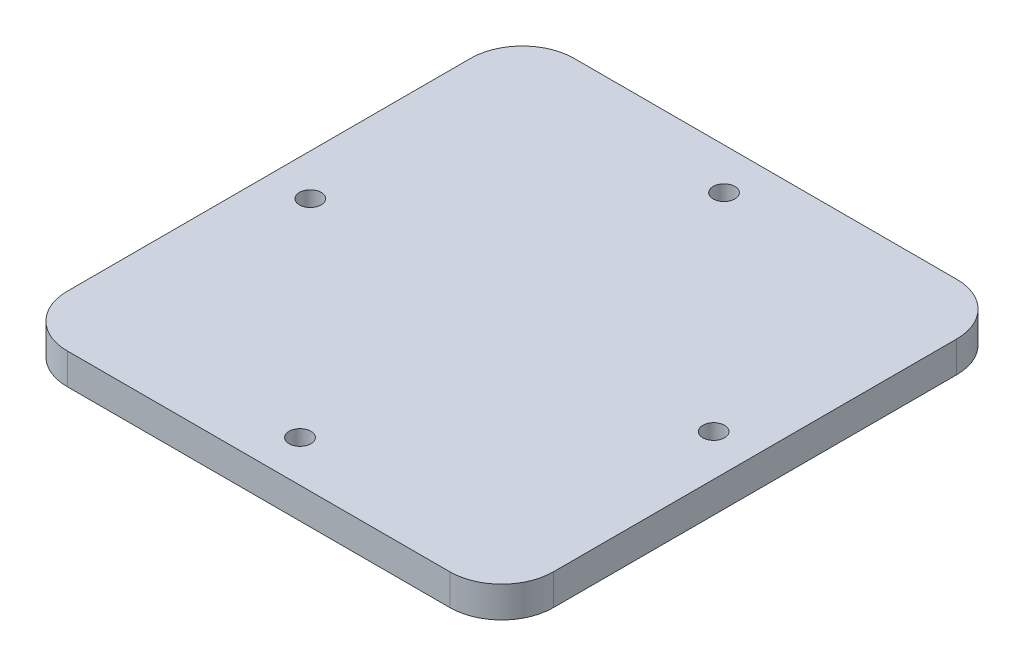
ISO-10303-21;
HEADER;
FILE_DESCRIPTION(('STEP AP214'),'2;1');
FILE_NAME('part.step','',(''),(''),'','','');
FILE_SCHEMA(('AUTOMOTIVE_DESIGN { 1 0 10303 214 1 1 1 1 }'));
ENDSEC;
DATA;
#1=APPLICATION_CONTEXT('core data for automotive mechanical design processes');
#2=APPLICATION_PROTOCOL_DEFINITION('international standard','automotive_design',2000,#1);
#3=PRODUCT_CONTEXT('',#1,'mechanical');
#4=PRODUCT('Part','Part','',(#3));
#5=PRODUCT_RELATED_PRODUCT_CATEGORY('part','',(#4));
#6=PRODUCT_DEFINITION_FORMATION('','',#4);
#7=PRODUCT_DEFINITION_CONTEXT('part definition',#1,'design');
#8=PRODUCT_DEFINITION('design','',#6,#7);
#9=PRODUCT_DEFINITION_SHAPE('','',#8);
#10=(LENGTH_UNIT() NAMED_UNIT(*) SI_UNIT(.MILLI.,.METRE.));
#11=(NAMED_UNIT(*) PLANE_ANGLE_UNIT() SI_UNIT($,.RADIAN.));
#12=(NAMED_UNIT(*) SI_UNIT($,.STERADIAN.) SOLID_ANGLE_UNIT());
#13=UNCERTAINTY_MEASURE_WITH_UNIT(LENGTH_MEASURE(1.E-05),#10,'distance_accuracy_value','');
#14=(GEOMETRIC_REPRESENTATION_CONTEXT(3) GLOBAL_UNCERTAINTY_ASSIGNED_CONTEXT((#13)) GLOBAL_UNIT_ASSIGNED_CONTEXT((#10,
#11,#12)) REPRESENTATION_CONTEXT('',''));
#15=CARTESIAN_POINT('',(0.,0.,0.));
#16=DIRECTION('',(0.,0.,1.));
#17=DIRECTION('',(1.,0.,0.));
#18=AXIS2_PLACEMENT_3D('',#15,#16,#17);
#19=CARTESIAN_POINT('',(9.99999999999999,0.,-88.));
#20=DIRECTION('',(0.,-1.,0.));
#21=DIRECTION('',(0.,0.,-1.));
#22=AXIS2_PLACEMENT_3D('',#19,#20,#21);
#23=PLANE('',#22);
#24=CARTESIAN_POINT('',(47.,0.,-90.));
#25=DIRECTION('',(0.,1.,0.));
#26=DIRECTION('',(0.,0.,1.));
#27=AXIS2_PLACEMENT_3D('',#24,#25,#26);
#28=CIRCLE('',#27,2.1);
#29=CARTESIAN_POINT('',(47.,0.,-87.9));
#30=VERTEX_POINT('',#29);
#31=EDGE_CURVE('E193',#30,#30,#28,.T.);
#32=ORIENTED_EDGE('',*,*,#31,.T.);
#33=EDGE_LOOP('',(#32));
#34=FACE_BOUND('',#33,.T.);
#35=CARTESIAN_POINT('',(7.99999999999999,0.,-49.));
#36=DIRECTION('',(0.,1.,0.));
#37=DIRECTION('',(0.,0.,1.));
#38=AXIS2_PLACEMENT_3D('',#35,#36,#37);
#39=CIRCLE('',#38,2.1);
#40=CARTESIAN_POINT('',(7.99999999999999,0.,-46.9));
#41=VERTEX_POINT('',#40);
#42=EDGE_CURVE('E187',#41,#41,#39,.T.);
#43=ORIENTED_EDGE('',*,*,#42,.T.);
#44=EDGE_LOOP('',(#43));
#45=FACE_BOUND('',#44,.T.);
#46=CARTESIAN_POINT('',(47.,0.,-8.));
#47=DIRECTION('',(0.,1.,0.));
#48=DIRECTION('',(0.,0.,1.));
#49=AXIS2_PLACEMENT_3D('',#46,#47,#48);
#50=CIRCLE('',#49,2.1);
#51=CARTESIAN_POINT('',(47.,0.,-5.9));
#52=VERTEX_POINT('',#51);
#53=EDGE_CURVE('E181',#52,#52,#50,.T.);
#54=ORIENTED_EDGE('',*,*,#53,.T.);
#55=EDGE_LOOP('',(#54));
#56=FACE_BOUND('',#55,.T.);
#57=CARTESIAN_POINT('',(9.99999999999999,0.,-88.));
#58=DIRECTION('',(0.,1.,0.));
#59=DIRECTION('',(0.,0.,-1.));
#60=AXIS2_PLACEMENT_3D('',#57,#58,#59);
#61=CIRCLE('',#60,10.);
#62=CARTESIAN_POINT('',(9.99999999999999,0.,-98.));
#63=VERTEX_POINT('',#62);
#64=CARTESIAN_POINT('',(0.,0.,-88.));
#65=VERTEX_POINT('',#64);
#66=EDGE_CURVE('E128',#63,#65,#61,.T.);
#67=ORIENTED_EDGE('',*,*,#66,.F.);
#68=DIRECTION('',(-1.,0.,0.));
#69=VECTOR('',#68,1.);
#70=CARTESIAN_POINT('',(9.99999999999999,0.,-98.));
#71=LINE('',#70,#69);
#72=CARTESIAN_POINT('',(84.,0.,-98.));
#73=VERTEX_POINT('',#72);
#74=EDGE_CURVE('E83',#73,#63,#71,.T.);
#75=ORIENTED_EDGE('',*,*,#74,.F.);
#76=CARTESIAN_POINT('',(84.,0.,-88.));
#77=DIRECTION('',(0.,1.,0.));
#78=DIRECTION('',(0.,0.,1.));
#79=AXIS2_PLACEMENT_3D('',#76,#77,#78);
#80=CIRCLE('',#79,9.99999999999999);
#81=CARTESIAN_POINT('',(94.,0.,-88.));
#82=VERTEX_POINT('',#81);
#83=EDGE_CURVE('E77',#82,#73,#80,.T.);
#84=ORIENTED_EDGE('',*,*,#83,.F.);
#85=DIRECTION('',(0.,0.,-1.));
#86=VECTOR('',#85,1.);
#87=CARTESIAN_POINT('',(94.,0.,-10.));
#88=LINE('',#87,#86);
#89=CARTESIAN_POINT('',(94.,0.,-10.));
#90=VERTEX_POINT('',#89);
#91=EDGE_CURVE('E118',#90,#82,#88,.T.);
#92=ORIENTED_EDGE('',*,*,#91,.F.);
#93=CARTESIAN_POINT('',(84.,0.,-10.));
#94=DIRECTION('',(0.,1.,0.));
#95=DIRECTION('',(0.,0.,-1.));
#96=AXIS2_PLACEMENT_3D('',#93,#94,#95);
#97=CIRCLE('',#96,10.);
#98=CARTESIAN_POINT('',(84.,0.,0.));
#99=VERTEX_POINT('',#98);
#100=EDGE_CURVE('E138',#99,#90,#97,.T.);
#101=ORIENTED_EDGE('',*,*,#100,.F.);
#102=DIRECTION('',(1.,0.,0.));
#103=VECTOR('',#102,1.);
#104=CARTESIAN_POINT('',(10.0000000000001,0.,0.));
#105=LINE('',#104,#103);
#106=CARTESIAN_POINT('',(10.0000000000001,0.,0.));
#107=VERTEX_POINT('',#106);
#108=EDGE_CURVE('E136',#107,#99,#105,.T.);
#109=ORIENTED_EDGE('',*,*,#108,.F.);
#110=CARTESIAN_POINT('',(10.,0.,-10.));
#111=DIRECTION('',(0.,1.,0.));
#112=DIRECTION('',(0.,0.,-1.));
#113=AXIS2_PLACEMENT_3D('',#110,#111,#112);
#114=CIRCLE('',#113,10.);
#115=CARTESIAN_POINT('',(0.,0.,-10.0000000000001));
#116=VERTEX_POINT('',#115);
#117=EDGE_CURVE('E134',#116,#107,#114,.T.);
#118=ORIENTED_EDGE('',*,*,#117,.F.);
#119=DIRECTION('',(0.,0.,1.));
#120=VECTOR('',#119,1.);
#121=CARTESIAN_POINT('',(0.,0.,-10.0000000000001));
#122=LINE('',#121,#120);
#123=EDGE_CURVE('E131',#65,#116,#122,.T.);
#124=ORIENTED_EDGE('',*,*,#123,.F.);
#125=EDGE_LOOP('',(#67,#75,#84,#92,#101,#109,#118,#124));
#126=FACE_BOUND('',#125,.T.);
#127=CARTESIAN_POINT('',(86.,0.,-49.));
#128=DIRECTION('',(0.,1.,0.));
#129=DIRECTION('',(0.,0.,1.));
#130=AXIS2_PLACEMENT_3D('',#127,#128,#129);
#131=CIRCLE('',#130,2.09999999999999);
#132=CARTESIAN_POINT('',(86.,0.,-46.9));
#133=VERTEX_POINT('',#132);
#134=EDGE_CURVE('E132',#133,#133,#131,.T.);
#135=ORIENTED_EDGE('',*,*,#134,.T.);
#136=EDGE_LOOP('',(#135));
#137=FACE_BOUND('',#136,.T.);
#138=ADVANCED_FACE('F31',(#34,#45,#56,#126,#137),#23,.T.);
#139=CARTESIAN_POINT('',(9.99999999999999,6.,-88.));
#140=DIRECTION('',(0.,-1.,0.));
#141=DIRECTION('',(0.,0.,-1.));
#142=AXIS2_PLACEMENT_3D('',#139,#140,#141);
#143=CYLINDRICAL_SURFACE('',#142,10.);
#144=ORIENTED_EDGE('',*,*,#66,.T.);
#145=DIRECTION('',(0.,-1.,0.));
#146=VECTOR('',#145,1.);
#147=CARTESIAN_POINT('',(0.,6.,-88.));
#148=LINE('',#147,#146);
#149=CARTESIAN_POINT('',(0.,6.,-88.));
#150=VERTEX_POINT('',#149);
#151=EDGE_CURVE('E11',#150,#65,#148,.T.);
#152=ORIENTED_EDGE('',*,*,#151,.F.);
#153=CARTESIAN_POINT('',(9.99999999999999,6.,-88.));
#154=DIRECTION('',(0.,1.,0.));
#155=DIRECTION('',(0.,0.,-1.));
#156=AXIS2_PLACEMENT_3D('',#153,#154,#155);
#157=CIRCLE('',#156,10.);
#158=CARTESIAN_POINT('',(9.99999999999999,6.,-98.));
#159=VERTEX_POINT('',#158);
#160=EDGE_CURVE('E143',#159,#150,#157,.T.);
#161=ORIENTED_EDGE('',*,*,#160,.F.);
#162=DIRECTION('',(0.,-1.,0.));
#163=VECTOR('',#162,1.);
#164=CARTESIAN_POINT('',(9.99999999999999,6.,-98.));
#165=LINE('',#164,#163);
#166=EDGE_CURVE('E124',#159,#63,#165,.T.);
#167=ORIENTED_EDGE('',*,*,#166,.T.);
#168=EDGE_LOOP('',(#144,#152,#161,#167));
#169=FACE_BOUND('',#168,.T.);
#170=ADVANCED_FACE('F33',(#169),#143,.T.);
#171=CARTESIAN_POINT('',(0.,6.,-10.0000000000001));
#172=DIRECTION('',(1.,0.,0.));
#173=DIRECTION('',(0.,0.,-1.));
#174=AXIS2_PLACEMENT_3D('',#171,#172,#173);
#175=PLANE('',#174);
#176=ORIENTED_EDGE('',*,*,#123,.T.);
#177=DIRECTION('',(0.,-1.,0.));
#178=VECTOR('',#177,1.);
#179=CARTESIAN_POINT('',(0.,6.,-10.0000000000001));
#180=LINE('',#179,#178);
#181=CARTESIAN_POINT('',(0.,6.,-10.0000000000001));
#182=VERTEX_POINT('',#181);
#183=EDGE_CURVE('E40',#182,#116,#180,.T.);
#184=ORIENTED_EDGE('',*,*,#183,.F.);
#185=DIRECTION('',(0.,0.,1.));
#186=VECTOR('',#185,1.);
#187=CARTESIAN_POINT('',(0.,6.,-10.0000000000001));
#188=LINE('',#187,#186);
#189=EDGE_CURVE('E91',#150,#182,#188,.T.);
#190=ORIENTED_EDGE('',*,*,#189,.F.);
#191=ORIENTED_EDGE('',*,*,#151,.T.);
#192=EDGE_LOOP('',(#176,#184,#190,#191));
#193=FACE_BOUND('',#192,.T.);
#194=ADVANCED_FACE('F230',(#193),#175,.F.);
#195=CARTESIAN_POINT('',(10.,6.,-10.));
#196=DIRECTION('',(0.,-1.,0.));
#197=DIRECTION('',(0.,0.,-1.));
#198=AXIS2_PLACEMENT_3D('',#195,#196,#197);
#199=CYLINDRICAL_SURFACE('',#198,10.);
#200=ORIENTED_EDGE('',*,*,#117,.T.);
#201=DIRECTION('',(0.,-1.,0.));
#202=VECTOR('',#201,1.);
#203=CARTESIAN_POINT('',(10.0000000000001,6.,0.));
#204=LINE('',#203,#202);
#205=CARTESIAN_POINT('',(10.0000000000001,6.,0.));
#206=VERTEX_POINT('',#205);
#207=EDGE_CURVE('E150',#206,#107,#204,.T.);
#208=ORIENTED_EDGE('',*,*,#207,.F.);
#209=CARTESIAN_POINT('',(10.,6.,-10.));
#210=DIRECTION('',(0.,1.,0.));
#211=DIRECTION('',(0.,0.,-1.));
#212=AXIS2_PLACEMENT_3D('',#209,#210,#211);
#213=CIRCLE('',#212,10.);
#214=EDGE_CURVE('E158',#182,#206,#213,.T.);
#215=ORIENTED_EDGE('',*,*,#214,.F.);
#216=ORIENTED_EDGE('',*,*,#183,.T.);
#217=EDGE_LOOP('',(#200,#208,#215,#216));
#218=FACE_BOUND('',#217,.T.);
#219=ADVANCED_FACE('F156',(#218),#199,.T.);
#220=CARTESIAN_POINT('',(10.0000000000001,6.,0.));
#221=DIRECTION('',(0.,0.,-1.));
#222=DIRECTION('',(-1.,0.,0.));
#223=AXIS2_PLACEMENT_3D('',#220,#221,#222);
#224=PLANE('',#223);
#225=ORIENTED_EDGE('',*,*,#108,.T.);
#226=DIRECTION('',(0.,-1.,0.));
#227=VECTOR('',#226,1.);
#228=CARTESIAN_POINT('',(84.,6.,0.));
#229=LINE('',#228,#227);
#230=CARTESIAN_POINT('',(84.,6.,0.));
#231=VERTEX_POINT('',#230);
#232=EDGE_CURVE('E147',#231,#99,#229,.T.);
#233=ORIENTED_EDGE('',*,*,#232,.F.);
#234=DIRECTION('',(1.,0.,0.));
#235=VECTOR('',#234,1.);
#236=CARTESIAN_POINT('',(10.0000000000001,6.,0.));
#237=LINE('',#236,#235);
#238=EDGE_CURVE('E170',#206,#231,#237,.T.);
#239=ORIENTED_EDGE('',*,*,#238,.F.);
#240=ORIENTED_EDGE('',*,*,#207,.T.);
#241=EDGE_LOOP('',(#225,#233,#239,#240));
#242=FACE_BOUND('',#241,.T.);
#243=ADVANCED_FACE('F166',(#242),#224,.F.);
#244=CARTESIAN_POINT('',(84.,6.,-10.));
#245=DIRECTION('',(0.,-1.,0.));
#246=DIRECTION('',(0.,0.,-1.));
#247=AXIS2_PLACEMENT_3D('',#244,#245,#246);
#248=CYLINDRICAL_SURFACE('',#247,10.);
#249=ORIENTED_EDGE('',*,*,#100,.T.);
#250=DIRECTION('',(0.,-1.,0.));
#251=VECTOR('',#250,1.);
#252=CARTESIAN_POINT('',(94.,6.,-10.));
#253=LINE('',#252,#251);
#254=CARTESIAN_POINT('',(94.,6.,-10.));
#255=VERTEX_POINT('',#254);
#256=EDGE_CURVE('E119',#255,#90,#253,.T.);
#257=ORIENTED_EDGE('',*,*,#256,.F.);
#258=CARTESIAN_POINT('',(84.,6.,-10.));
#259=DIRECTION('',(0.,1.,0.));
#260=DIRECTION('',(0.,0.,-1.));
#261=AXIS2_PLACEMENT_3D('',#258,#259,#260);
#262=CIRCLE('',#261,10.);
#263=EDGE_CURVE('E110',#231,#255,#262,.T.);
#264=ORIENTED_EDGE('',*,*,#263,.F.);
#265=ORIENTED_EDGE('',*,*,#232,.T.);
#266=EDGE_LOOP('',(#249,#257,#264,#265));
#267=FACE_BOUND('',#266,.T.);
#268=ADVANCED_FACE('F169',(#267),#248,.T.);
#269=CARTESIAN_POINT('',(94.,6.,-10.));
#270=DIRECTION('',(-1.,0.,0.));
#271=DIRECTION('',(0.,0.,1.));
#272=AXIS2_PLACEMENT_3D('',#269,#270,#271);
#273=PLANE('',#272);
#274=ORIENTED_EDGE('',*,*,#91,.T.);
#275=DIRECTION('',(0.,-1.,0.));
#276=VECTOR('',#275,1.);
#277=CARTESIAN_POINT('',(94.,6.,-88.));
#278=LINE('',#277,#276);
#279=CARTESIAN_POINT('',(94.,6.,-88.));
#280=VERTEX_POINT('',#279);
#281=EDGE_CURVE('E115',#280,#82,#278,.T.);
#282=ORIENTED_EDGE('',*,*,#281,.F.);
#283=DIRECTION('',(0.,0.,-1.));
#284=VECTOR('',#283,1.);
#285=CARTESIAN_POINT('',(94.,6.,-10.));
#286=LINE('',#285,#284);
#287=EDGE_CURVE('E104',#255,#280,#286,.T.);
#288=ORIENTED_EDGE('',*,*,#287,.F.);
#289=ORIENTED_EDGE('',*,*,#256,.T.);
#290=EDGE_LOOP('',(#274,#282,#288,#289));
#291=FACE_BOUND('',#290,.T.);
#292=ADVANCED_FACE('F116',(#291),#273,.F.);
#293=CARTESIAN_POINT('',(84.,6.,-88.));
#294=DIRECTION('',(0.,-1.,0.));
#295=DIRECTION('',(0.,0.,-1.));
#296=AXIS2_PLACEMENT_3D('',#293,#294,#295);
#297=CYLINDRICAL_SURFACE('',#296,9.99999999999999);
#298=ORIENTED_EDGE('',*,*,#83,.T.);
#299=DIRECTION('',(0.,-1.,0.));
#300=VECTOR('',#299,1.);
#301=CARTESIAN_POINT('',(84.,6.,-98.));
#302=LINE('',#301,#300);
#303=CARTESIAN_POINT('',(84.,6.,-98.));
#304=VERTEX_POINT('',#303);
#305=EDGE_CURVE('E120',#304,#73,#302,.T.);
#306=ORIENTED_EDGE('',*,*,#305,.F.);
#307=CARTESIAN_POINT('',(84.,6.,-88.));
#308=DIRECTION('',(0.,1.,0.));
#309=DIRECTION('',(0.,0.,1.));
#310=AXIS2_PLACEMENT_3D('',#307,#308,#309);
#311=CIRCLE('',#310,9.99999999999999);
#312=EDGE_CURVE('E108',#280,#304,#311,.T.);
#313=ORIENTED_EDGE('',*,*,#312,.F.);
#314=ORIENTED_EDGE('',*,*,#281,.T.);
#315=EDGE_LOOP('',(#298,#306,#313,#314));
#316=FACE_BOUND('',#315,.T.);
#317=ADVANCED_FACE('F122',(#316),#297,.T.);
#318=CARTESIAN_POINT('',(9.99999999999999,6.,-98.));
#319=DIRECTION('',(0.,0.,1.));
#320=DIRECTION('',(1.,0.,0.));
#321=AXIS2_PLACEMENT_3D('',#318,#319,#320);
#322=PLANE('',#321);
#323=ORIENTED_EDGE('',*,*,#74,.T.);
#324=ORIENTED_EDGE('',*,*,#166,.F.);
#325=DIRECTION('',(-1.,0.,0.));
#326=VECTOR('',#325,1.);
#327=CARTESIAN_POINT('',(9.99999999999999,6.,-98.));
#328=LINE('',#327,#326);
#329=EDGE_CURVE('E48',#304,#159,#328,.T.);
#330=ORIENTED_EDGE('',*,*,#329,.F.);
#331=ORIENTED_EDGE('',*,*,#305,.T.);
#332=EDGE_LOOP('',(#323,#324,#330,#331));
#333=FACE_BOUND('',#332,.T.);
#334=ADVANCED_FACE('F205',(#333),#322,.F.);
#335=CARTESIAN_POINT('',(9.99999999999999,6.,-88.));
#336=DIRECTION('',(0.,-1.,0.));
#337=DIRECTION('',(0.,0.,-1.));
#338=AXIS2_PLACEMENT_3D('',#335,#336,#337);
#339=PLANE('',#338);
#340=CARTESIAN_POINT('',(47.,6.,-90.));
#341=DIRECTION('',(0.,1.,0.));
#342=DIRECTION('',(0.,0.,1.));
#343=AXIS2_PLACEMENT_3D('',#340,#341,#342);
#344=CIRCLE('',#343,2.09999999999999);
#345=CARTESIAN_POINT('',(47.,6.,-87.9));
#346=VERTEX_POINT('',#345);
#347=EDGE_CURVE('E196',#346,#346,#344,.T.);
#348=ORIENTED_EDGE('',*,*,#347,.F.);
#349=EDGE_LOOP('',(#348));
#350=FACE_BOUND('',#349,.T.);
#351=CARTESIAN_POINT('',(7.99999999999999,6.,-49.));
#352=DIRECTION('',(0.,1.,0.));
#353=DIRECTION('',(0.,0.,1.));
#354=AXIS2_PLACEMENT_3D('',#351,#352,#353);
#355=CIRCLE('',#354,2.09999999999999);
#356=CARTESIAN_POINT('',(7.99999999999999,6.,-46.9));
#357=VERTEX_POINT('',#356);
#358=EDGE_CURVE('E190',#357,#357,#355,.T.);
#359=ORIENTED_EDGE('',*,*,#358,.F.);
#360=EDGE_LOOP('',(#359));
#361=FACE_BOUND('',#360,.T.);
#362=CARTESIAN_POINT('',(47.,6.,-8.));
#363=DIRECTION('',(0.,1.,0.));
#364=DIRECTION('',(0.,0.,1.));
#365=AXIS2_PLACEMENT_3D('',#362,#363,#364);
#366=CIRCLE('',#365,2.09999999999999);
#367=CARTESIAN_POINT('',(47.,6.,-5.90000000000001));
#368=VERTEX_POINT('',#367);
#369=EDGE_CURVE('E184',#368,#368,#366,.T.);
#370=ORIENTED_EDGE('',*,*,#369,.F.);
#371=EDGE_LOOP('',(#370));
#372=FACE_BOUND('',#371,.T.);
#373=CARTESIAN_POINT('',(86.,6.,-49.));
#374=DIRECTION('',(0.,1.,0.));
#375=DIRECTION('',(0.,0.,1.));
#376=AXIS2_PLACEMENT_3D('',#373,#374,#375);
#377=CIRCLE('',#376,2.09999999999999);
#378=CARTESIAN_POINT('',(86.,6.,-46.9));
#379=VERTEX_POINT('',#378);
#380=EDGE_CURVE('E178',#379,#379,#377,.T.);
#381=ORIENTED_EDGE('',*,*,#380,.F.);
#382=EDGE_LOOP('',(#381));
#383=FACE_BOUND('',#382,.T.);
#384=ORIENTED_EDGE('',*,*,#160,.T.);
#385=ORIENTED_EDGE('',*,*,#189,.T.);
#386=ORIENTED_EDGE('',*,*,#214,.T.);
#387=ORIENTED_EDGE('',*,*,#238,.T.);
#388=ORIENTED_EDGE('',*,*,#263,.T.);
#389=ORIENTED_EDGE('',*,*,#287,.T.);
#390=ORIENTED_EDGE('',*,*,#312,.T.);
#391=ORIENTED_EDGE('',*,*,#329,.T.);
#392=EDGE_LOOP('',(#384,#385,#386,#387,#388,#389,#390,#391));
#393=FACE_BOUND('',#392,.T.);
#394=ADVANCED_FACE('F106',(#350,#361,#372,#383,#393),#339,.F.);
#395=CARTESIAN_POINT('',(86.,6.,-49.));
#396=DIRECTION('',(0.,1.,0.));
#397=DIRECTION('',(0.,0.,1.));
#398=AXIS2_PLACEMENT_3D('',#395,#396,#397);
#399=CYLINDRICAL_SURFACE('',#398,2.09999999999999);
#400=ORIENTED_EDGE('',*,*,#134,.F.);
#401=EDGE_LOOP('',(#400));
#402=FACE_BOUND('',#401,.T.);
#403=ORIENTED_EDGE('',*,*,#380,.T.);
#404=EDGE_LOOP('',(#403));
#405=FACE_BOUND('',#404,.T.);
#406=ADVANCED_FACE('F204',(#402,#405),#399,.F.);
#407=CARTESIAN_POINT('',(47.,6.,-8.));
#408=DIRECTION('',(0.,1.,0.));
#409=DIRECTION('',(0.,0.,1.));
#410=AXIS2_PLACEMENT_3D('',#407,#408,#409);
#411=CYLINDRICAL_SURFACE('',#410,2.09999999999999);
#412=ORIENTED_EDGE('',*,*,#53,.F.);
#413=EDGE_LOOP('',(#412));
#414=FACE_BOUND('',#413,.T.);
#415=ORIENTED_EDGE('',*,*,#369,.T.);
#416=EDGE_LOOP('',(#415));
#417=FACE_BOUND('',#416,.T.);
#418=ADVANCED_FACE('F214',(#414,#417),#411,.F.);
#419=CARTESIAN_POINT('',(7.99999999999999,6.,-49.));
#420=DIRECTION('',(0.,1.,0.));
#421=DIRECTION('',(0.,0.,1.));
#422=AXIS2_PLACEMENT_3D('',#419,#420,#421);
#423=CYLINDRICAL_SURFACE('',#422,2.09999999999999);
#424=ORIENTED_EDGE('',*,*,#42,.F.);
#425=EDGE_LOOP('',(#424));
#426=FACE_BOUND('',#425,.T.);
#427=ORIENTED_EDGE('',*,*,#358,.T.);
#428=EDGE_LOOP('',(#427));
#429=FACE_BOUND('',#428,.T.);
#430=ADVANCED_FACE('F220',(#426,#429),#423,.F.);
#431=CARTESIAN_POINT('',(47.,6.,-90.));
#432=DIRECTION('',(0.,1.,0.));
#433=DIRECTION('',(0.,0.,1.));
#434=AXIS2_PLACEMENT_3D('',#431,#432,#433);
#435=CYLINDRICAL_SURFACE('',#434,2.09999999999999);
#436=ORIENTED_EDGE('',*,*,#31,.F.);
#437=EDGE_LOOP('',(#436));
#438=FACE_BOUND('',#437,.T.);
#439=ORIENTED_EDGE('',*,*,#347,.T.);
#440=EDGE_LOOP('',(#439));
#441=FACE_BOUND('',#440,.T.);
#442=ADVANCED_FACE('F200',(#438,#441),#435,.F.);
#443=CLOSED_SHELL('',(#138,#170,#194,#219,#243,#268,#292,#317,#334,#394,#406,#418,#430,#442));
#444=MANIFOLD_SOLID_BREP('B2',#443);
#445=ADVANCED_BREP_SHAPE_REPRESENTATION('',(#18,#444),#14);
#446=SHAPE_DEFINITION_REPRESENTATION(#9,#445);
ENDSEC;
END-ISO-10303-21;
